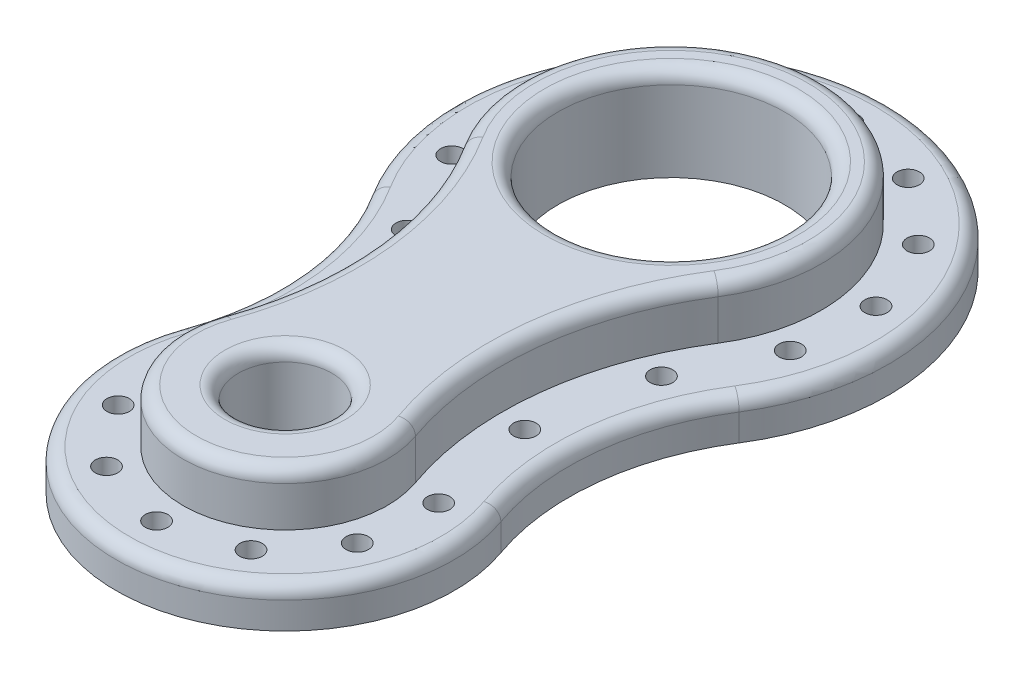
ISO-10303-21;
HEADER;
FILE_DESCRIPTION(('STEP AP214'),'2;1');
FILE_NAME('part.step','',(''),(''),'','','');
FILE_SCHEMA(('AUTOMOTIVE_DESIGN { 1 0 10303 214 1 1 1 1 }'));
ENDSEC;
DATA;
#1=APPLICATION_CONTEXT('core data for automotive mechanical design processes');
#2=APPLICATION_PROTOCOL_DEFINITION('international standard','automotive_design',2000,#1);
#3=PRODUCT_CONTEXT('',#1,'mechanical');
#4=PRODUCT('Part','Part','',(#3));
#5=PRODUCT_RELATED_PRODUCT_CATEGORY('part','',(#4));
#6=PRODUCT_DEFINITION_FORMATION('','',#4);
#7=PRODUCT_DEFINITION_CONTEXT('part definition',#1,'design');
#8=PRODUCT_DEFINITION('design','',#6,#7);
#9=PRODUCT_DEFINITION_SHAPE('','',#8);
#10=(LENGTH_UNIT() NAMED_UNIT(*) SI_UNIT(.MILLI.,.METRE.));
#11=(NAMED_UNIT(*) PLANE_ANGLE_UNIT() SI_UNIT($,.RADIAN.));
#12=(NAMED_UNIT(*) SI_UNIT($,.STERADIAN.) SOLID_ANGLE_UNIT());
#13=UNCERTAINTY_MEASURE_WITH_UNIT(LENGTH_MEASURE(1.E-05),#10,'distance_accuracy_value','');
#14=(GEOMETRIC_REPRESENTATION_CONTEXT(3) GLOBAL_UNCERTAINTY_ASSIGNED_CONTEXT((#13)) GLOBAL_UNIT_ASSIGNED_CONTEXT((#10,
#11,#12)) REPRESENTATION_CONTEXT('',''));
#15=CARTESIAN_POINT('',(0.,0.,0.));
#16=DIRECTION('',(0.,0.,1.));
#17=DIRECTION('',(1.,0.,0.));
#18=AXIS2_PLACEMENT_3D('',#15,#16,#17);
#19=CARTESIAN_POINT('',(37.2281633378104,7.62,-49.7239882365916));
#20=DIRECTION('',(0.,-1.,0.));
#21=DIRECTION('',(0.,0.,-1.));
#22=AXIS2_PLACEMENT_3D('',#19,#20,#21);
#23=PLANE('',#22);
#24=CARTESIAN_POINT('',(-13.6992201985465,7.62,20.1720306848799));
#25=DIRECTION('',(0.,1.,0.));
#26=DIRECTION('',(0.,0.,1.));
#27=AXIS2_PLACEMENT_3D('',#24,#25,#26);
#28=CIRCLE('',#27,2.1290551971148);
#29=CARTESIAN_POINT('',(-13.6992201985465,7.62,22.3010858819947));
#30=VERTEX_POINT('',#29);
#31=EDGE_CURVE('E484',#30,#30,#28,.T.);
#32=ORIENTED_EDGE('',*,*,#31,.F.);
#33=EDGE_LOOP('',(#32));
#34=FACE_BOUND('',#33,.T.);
#35=CARTESIAN_POINT('',(-22.6657718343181,7.62,8.99123145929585));
#36=DIRECTION('',(0.,1.,0.));
#37=DIRECTION('',(0.,0.,1.));
#38=AXIS2_PLACEMENT_3D('',#35,#36,#37);
#39=CIRCLE('',#38,2.1290551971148);
#40=CARTESIAN_POINT('',(-22.6657718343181,7.62,11.1202866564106));
#41=VERTEX_POINT('',#40);
#42=EDGE_CURVE('E486',#41,#41,#39,.T.);
#43=ORIENTED_EDGE('',*,*,#42,.F.);
#44=EDGE_LOOP('',(#43));
#45=FACE_BOUND('',#44,.T.);
#46=CARTESIAN_POINT('',(-23.8019809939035,7.62,-5.29576781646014));
#47=DIRECTION('',(0.,1.,0.));
#48=DIRECTION('',(0.,0.,1.));
#49=AXIS2_PLACEMENT_3D('',#46,#47,#48);
#50=CIRCLE('',#49,2.1290551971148);
#51=CARTESIAN_POINT('',(-23.8019809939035,7.62,-3.16671261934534));
#52=VERTEX_POINT('',#51);
#53=EDGE_CURVE('E492',#52,#52,#50,.T.);
#54=ORIENTED_EDGE('',*,*,#53,.F.);
#55=EDGE_LOOP('',(#54));
#56=FACE_BOUND('',#55,.T.);
#57=CARTESIAN_POINT('',(-19.8981874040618,7.62,-25.5370680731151));
#58=DIRECTION('',(0.,1.,0.));
#59=DIRECTION('',(0.,0.,1.));
#60=AXIS2_PLACEMENT_3D('',#57,#58,#59);
#61=CIRCLE('',#60,2.1290551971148);
#62=CARTESIAN_POINT('',(-19.8981874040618,7.62,-23.4080128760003));
#63=VERTEX_POINT('',#62);
#64=EDGE_CURVE('E498',#63,#63,#61,.T.);
#65=ORIENTED_EDGE('',*,*,#64,.F.);
#66=EDGE_LOOP('',(#65));
#67=FACE_BOUND('',#66,.T.);
#68=CARTESIAN_POINT('',(-24.0942564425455,7.62,-47.2399913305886));
#69=DIRECTION('',(0.,1.,0.));
#70=DIRECTION('',(0.,0.,1.));
#71=AXIS2_PLACEMENT_3D('',#68,#69,#70);
#72=CIRCLE('',#71,2.1290551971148);
#73=CARTESIAN_POINT('',(-24.0942564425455,7.62,-45.1109361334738));
#74=VERTEX_POINT('',#73);
#75=EDGE_CURVE('E504',#74,#74,#72,.T.);
#76=ORIENTED_EDGE('',*,*,#75,.F.);
#77=EDGE_LOOP('',(#76));
#78=FACE_BOUND('',#77,.T.);
#79=CARTESIAN_POINT('',(-32.0772385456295,7.62,-63.6698601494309));
#80=DIRECTION('',(0.,1.,0.));
#81=DIRECTION('',(0.,0.,1.));
#82=AXIS2_PLACEMENT_3D('',#79,#80,#81);
#83=CIRCLE('',#82,2.1290551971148);
#84=CARTESIAN_POINT('',(-32.0772385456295,7.62,-61.5408049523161));
#85=VERTEX_POINT('',#84);
#86=EDGE_CURVE('E510',#85,#85,#83,.T.);
#87=ORIENTED_EDGE('',*,*,#86,.F.);
#88=EDGE_LOOP('',(#87));
#89=FACE_BOUND('',#88,.T.);
#90=CARTESIAN_POINT('',(-32.9463323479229,7.62,-79.0632797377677));
#91=DIRECTION('',(0.,1.,0.));
#92=DIRECTION('',(0.,0.,1.));
#93=AXIS2_PLACEMENT_3D('',#90,#91,#92);
#94=CIRCLE('',#93,2.1290551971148);
#95=CARTESIAN_POINT('',(-32.9463323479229,7.62,-76.9342245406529));
#96=VERTEX_POINT('',#95);
#97=EDGE_CURVE('E516',#96,#96,#94,.T.);
#98=ORIENTED_EDGE('',*,*,#97,.F.);
#99=EDGE_LOOP('',(#98));
#100=FACE_BOUND('',#99,.T.);
#101=CARTESIAN_POINT('',(-26.8216188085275,7.62,-93.2125049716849));
#102=DIRECTION('',(0.,1.,0.));
#103=DIRECTION('',(0.,0.,1.));
#104=AXIS2_PLACEMENT_3D('',#101,#102,#103);
#105=CIRCLE('',#104,2.1290551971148);
#106=CARTESIAN_POINT('',(-26.8216188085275,7.62,-91.0834497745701));
#107=VERTEX_POINT('',#106);
#108=EDGE_CURVE('E522',#107,#107,#105,.T.);
#109=ORIENTED_EDGE('',*,*,#108,.F.);
#110=EDGE_LOOP('',(#109));
#111=FACE_BOUND('',#110,.T.);
#112=CARTESIAN_POINT('',(-15.0032446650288,7.62,-103.113955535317));
#113=DIRECTION('',(0.,1.,0.));
#114=DIRECTION('',(0.,0.,1.));
#115=AXIS2_PLACEMENT_3D('',#112,#113,#114);
#116=CIRCLE('',#115,2.1290551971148);
#117=CARTESIAN_POINT('',(-15.0032446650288,7.62,-100.984900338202));
#118=VERTEX_POINT('',#117);
#119=EDGE_CURVE('E528',#118,#118,#116,.T.);
#120=ORIENTED_EDGE('',*,*,#119,.F.);
#121=EDGE_LOOP('',(#120));
#122=FACE_BOUND('',#121,.T.);
#123=CARTESIAN_POINT('',(0.,7.62,-106.665763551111));
#124=DIRECTION('',(0.,1.,0.));
#125=DIRECTION('',(0.,0.,1.));
#126=AXIS2_PLACEMENT_3D('',#123,#124,#125);
#127=CIRCLE('',#126,2.1290551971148);
#128=CARTESIAN_POINT('',(0.,7.62,-104.536708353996));
#129=VERTEX_POINT('',#128);
#130=EDGE_CURVE('E534',#129,#129,#127,.T.);
#131=ORIENTED_EDGE('',*,*,#130,.F.);
#132=EDGE_LOOP('',(#131));
#133=FACE_BOUND('',#132,.T.);
#134=CARTESIAN_POINT('',(15.0032446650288,7.62,-103.113955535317));
#135=DIRECTION('',(0.,1.,0.));
#136=DIRECTION('',(0.,0.,1.));
#137=AXIS2_PLACEMENT_3D('',#134,#135,#136);
#138=CIRCLE('',#137,2.1290551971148);
#139=CARTESIAN_POINT('',(15.0032446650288,7.62,-100.984900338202));
#140=VERTEX_POINT('',#139);
#141=EDGE_CURVE('E540',#140,#140,#138,.T.);
#142=ORIENTED_EDGE('',*,*,#141,.F.);
#143=EDGE_LOOP('',(#142));
#144=FACE_BOUND('',#143,.T.);
#145=CARTESIAN_POINT('',(26.8216188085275,7.62,-93.2125049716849));
#146=DIRECTION('',(0.,1.,0.));
#147=DIRECTION('',(0.,0.,1.));
#148=AXIS2_PLACEMENT_3D('',#145,#146,#147);
#149=CIRCLE('',#148,2.1290551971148);
#150=CARTESIAN_POINT('',(26.8216188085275,7.62,-91.0834497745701));
#151=VERTEX_POINT('',#150);
#152=EDGE_CURVE('E546',#151,#151,#149,.T.);
#153=ORIENTED_EDGE('',*,*,#152,.F.);
#154=EDGE_LOOP('',(#153));
#155=FACE_BOUND('',#154,.T.);
#156=CARTESIAN_POINT('',(32.9463323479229,7.62,-79.0632797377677));
#157=DIRECTION('',(0.,1.,0.));
#158=DIRECTION('',(0.,0.,1.));
#159=AXIS2_PLACEMENT_3D('',#156,#157,#158);
#160=CIRCLE('',#159,2.1290551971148);
#161=CARTESIAN_POINT('',(32.9463323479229,7.62,-76.9342245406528));
#162=VERTEX_POINT('',#161);
#163=EDGE_CURVE('E552',#162,#162,#160,.T.);
#164=ORIENTED_EDGE('',*,*,#163,.F.);
#165=EDGE_LOOP('',(#164));
#166=FACE_BOUND('',#165,.T.);
#167=CARTESIAN_POINT('',(32.0772385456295,7.62,-63.6698601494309));
#168=DIRECTION('',(0.,1.,0.));
#169=DIRECTION('',(0.,0.,1.));
#170=AXIS2_PLACEMENT_3D('',#167,#168,#169);
#171=CIRCLE('',#170,2.1290551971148);
#172=CARTESIAN_POINT('',(32.0772385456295,7.62,-61.5408049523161));
#173=VERTEX_POINT('',#172);
#174=EDGE_CURVE('E558',#173,#173,#171,.T.);
#175=ORIENTED_EDGE('',*,*,#174,.F.);
#176=EDGE_LOOP('',(#175));
#177=FACE_BOUND('',#176,.T.);
#178=CARTESIAN_POINT('',(24.0942564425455,7.62,-47.2399913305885));
#179=DIRECTION('',(0.,1.,0.));
#180=DIRECTION('',(0.,0.,1.));
#181=AXIS2_PLACEMENT_3D('',#178,#179,#180);
#182=CIRCLE('',#181,2.1290551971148);
#183=CARTESIAN_POINT('',(24.0942564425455,7.62,-45.1109361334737));
#184=VERTEX_POINT('',#183);
#185=EDGE_CURVE('E564',#184,#184,#182,.T.);
#186=ORIENTED_EDGE('',*,*,#185,.F.);
#187=EDGE_LOOP('',(#186));
#188=FACE_BOUND('',#187,.T.);
#189=CARTESIAN_POINT('',(19.8981874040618,7.62,-25.537068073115));
#190=DIRECTION('',(0.,1.,0.));
#191=DIRECTION('',(0.,0.,1.));
#192=AXIS2_PLACEMENT_3D('',#189,#190,#191);
#193=CIRCLE('',#192,2.1290551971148);
#194=CARTESIAN_POINT('',(19.8981874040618,7.62,-23.4080128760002));
#195=VERTEX_POINT('',#194);
#196=EDGE_CURVE('E570',#195,#195,#193,.T.);
#197=ORIENTED_EDGE('',*,*,#196,.F.);
#198=EDGE_LOOP('',(#197));
#199=FACE_BOUND('',#198,.T.);
#200=CARTESIAN_POINT('',(23.8019809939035,7.62,-5.29576781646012));
#201=DIRECTION('',(0.,1.,0.));
#202=DIRECTION('',(0.,0.,1.));
#203=AXIS2_PLACEMENT_3D('',#200,#201,#202);
#204=CIRCLE('',#203,2.1290551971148);
#205=CARTESIAN_POINT('',(23.8019809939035,7.62,-3.16671261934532));
#206=VERTEX_POINT('',#205);
#207=EDGE_CURVE('E576',#206,#206,#204,.T.);
#208=ORIENTED_EDGE('',*,*,#207,.F.);
#209=EDGE_LOOP('',(#208));
#210=FACE_BOUND('',#209,.T.);
#211=CARTESIAN_POINT('',(22.6657718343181,7.62,8.99123145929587));
#212=DIRECTION('',(0.,1.,0.));
#213=DIRECTION('',(0.,0.,1.));
#214=AXIS2_PLACEMENT_3D('',#211,#212,#213);
#215=CIRCLE('',#214,2.1290551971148);
#216=CARTESIAN_POINT('',(22.6657718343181,7.62,11.1202866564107));
#217=VERTEX_POINT('',#216);
#218=EDGE_CURVE('E582',#217,#217,#215,.T.);
#219=ORIENTED_EDGE('',*,*,#218,.F.);
#220=EDGE_LOOP('',(#219));
#221=FACE_BOUND('',#220,.T.);
#222=CARTESIAN_POINT('',(13.6992201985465,7.62,20.1720306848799));
#223=DIRECTION('',(0.,1.,0.));
#224=DIRECTION('',(0.,0.,1.));
#225=AXIS2_PLACEMENT_3D('',#222,#223,#224);
#226=CIRCLE('',#225,2.1290551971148);
#227=CARTESIAN_POINT('',(13.6992201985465,7.62,22.3010858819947));
#228=VERTEX_POINT('',#227);
#229=EDGE_CURVE('E588',#228,#228,#226,.T.);
#230=ORIENTED_EDGE('',*,*,#229,.F.);
#231=EDGE_LOOP('',(#230));
#232=FACE_BOUND('',#231,.T.);
#233=CARTESIAN_POINT('',(0.,7.62,24.384));
#234=DIRECTION('',(0.,1.,0.));
#235=DIRECTION('',(0.,0.,1.));
#236=AXIS2_PLACEMENT_3D('',#233,#234,#235);
#237=CIRCLE('',#236,2.1290551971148);
#238=CARTESIAN_POINT('',(0.,7.62,26.5130551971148));
#239=VERTEX_POINT('',#238);
#240=EDGE_CURVE('E366',#239,#239,#237,.T.);
#241=ORIENTED_EDGE('',*,*,#240,.F.);
#242=EDGE_LOOP('',(#241));
#243=FACE_BOUND('',#242,.T.);
#244=CARTESIAN_POINT('',(0.,7.62,0.));
#245=DIRECTION('',(0.,-1.,0.));
#246=DIRECTION('',(0.,0.,-1.));
#247=AXIS2_PLACEMENT_3D('',#244,#245,#246);
#248=CIRCLE('',#247,29.5212641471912);
#249=CARTESIAN_POINT('',(-27.8421225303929,7.62,-9.81433899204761));
#250=VERTEX_POINT('',#249);
#251=CARTESIAN_POINT('',(27.8421225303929,7.62,-9.8143389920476));
#252=VERTEX_POINT('',#251);
#253=EDGE_CURVE('E242',#250,#252,#248,.F.);
#254=ORIENTED_EDGE('',*,*,#253,.T.);
#255=CARTESIAN_POINT('',(74.4563266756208,7.62,-26.2458305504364));
#256=DIRECTION('',(0.,-1.,0.));
#257=DIRECTION('',(0.,0.,-1.));
#258=AXIS2_PLACEMENT_3D('',#255,#256,#257);
#259=CIRCLE('',#258,49.4254786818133);
#260=CARTESIAN_POINT('',(32.6502180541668,7.62,-52.611096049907));
#261=VERTEX_POINT('',#260);
#262=EDGE_CURVE('E244',#252,#261,#259,.T.);
#263=ORIENTED_EDGE('',*,*,#262,.T.);
#264=CARTESIAN_POINT('',(0.,7.62,-73.2021459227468));
#265=DIRECTION('',(0.,-1.,0.));
#266=DIRECTION('',(0.,0.,-1.));
#267=AXIS2_PLACEMENT_3D('',#264,#265,#266);
#268=CIRCLE('',#267,38.6008817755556);
#269=CARTESIAN_POINT('',(-32.6502180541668,7.62,-52.611096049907));
#270=VERTEX_POINT('',#269);
#271=EDGE_CURVE('E227',#261,#270,#268,.F.);
#272=ORIENTED_EDGE('',*,*,#271,.T.);
#273=CARTESIAN_POINT('',(-74.4563266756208,7.62,-26.2458305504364));
#274=DIRECTION('',(0.,-1.,0.));
#275=DIRECTION('',(0.,0.,-1.));
#276=AXIS2_PLACEMENT_3D('',#273,#274,#275);
#277=CIRCLE('',#276,49.4254786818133);
#278=EDGE_CURVE('E240',#270,#250,#277,.T.);
#279=ORIENTED_EDGE('',*,*,#278,.T.);
#280=EDGE_LOOP('',(#254,#263,#272,#279));
#281=FACE_BOUND('',#280,.T.);
#282=CARTESIAN_POINT('',(74.4563266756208,7.62,-26.2458305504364));
#283=DIRECTION('',(0.,-1.,0.));
#284=DIRECTION('',(0.,0.,1.));
#285=AXIS2_PLACEMENT_3D('',#282,#283,#284);
#286=CIRCLE('',#285,59.5854786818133);
#287=CARTESIAN_POINT('',(18.2600137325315,7.62,-6.43664880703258));
#288=VERTEX_POINT('',#287);
#289=CARTESIAN_POINT('',(24.0564709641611,7.62,-58.0307926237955));
#290=VERTEX_POINT('',#289);
#291=EDGE_CURVE('E160',#288,#290,#286,.T.);
#292=ORIENTED_EDGE('',*,*,#291,.F.);
#293=CARTESIAN_POINT('',(0.,7.62,0.));
#294=DIRECTION('',(0.,1.,0.));
#295=DIRECTION('',(0.,0.,1.));
#296=AXIS2_PLACEMENT_3D('',#293,#294,#295);
#297=CIRCLE('',#296,19.3612641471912);
#298=CARTESIAN_POINT('',(-18.2600137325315,7.62,-6.4366488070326));
#299=VERTEX_POINT('',#298);
#300=EDGE_CURVE('E167',#299,#288,#297,.T.);
#301=ORIENTED_EDGE('',*,*,#300,.F.);
#302=CARTESIAN_POINT('',(-74.4563266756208,7.62,-26.2458305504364));
#303=DIRECTION('',(0.,-1.,0.));
#304=DIRECTION('',(0.,0.,1.));
#305=AXIS2_PLACEMENT_3D('',#302,#303,#304);
#306=CIRCLE('',#305,59.5854786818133);
#307=CARTESIAN_POINT('',(-24.0564709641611,7.62,-58.0307926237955));
#308=VERTEX_POINT('',#307);
#309=EDGE_CURVE('E180',#308,#299,#306,.T.);
#310=ORIENTED_EDGE('',*,*,#309,.F.);
#311=CARTESIAN_POINT('',(0.,7.62,-73.2021459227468));
#312=DIRECTION('',(0.,1.,0.));
#313=DIRECTION('',(0.,0.,1.));
#314=AXIS2_PLACEMENT_3D('',#311,#312,#313);
#315=CIRCLE('',#314,28.4408817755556);
#316=EDGE_CURVE('E175',#290,#308,#315,.T.);
#317=ORIENTED_EDGE('',*,*,#316,.F.);
#318=EDGE_LOOP('',(#292,#301,#310,#317));
#319=FACE_BOUND('',#318,.T.);
#320=ADVANCED_FACE('F64',(#34,#45,#56,#67,#78,#89,#100,#111,#122,#133,#144,#155,#166,#177,#188,
#199,#210,#221,#232,#243,#281,#319),#23,.F.);
#321=CARTESIAN_POINT('',(74.4563266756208,7.62,-26.2458305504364));
#322=DIRECTION('',(0.,-1.,0.));
#323=DIRECTION('',(0.,0.,-1.));
#324=AXIS2_PLACEMENT_3D('',#321,#322,#323);
#325=CYLINDRICAL_SURFACE('',#324,46.8854786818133);
#326=DIRECTION('',(0.,-1.,0.));
#327=VECTOR('',#326,1.);
#328=CARTESIAN_POINT('',(34.7986548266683,7.62,-51.2561719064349));
#329=LINE('',#328,#327);
#330=CARTESIAN_POINT('',(34.7986548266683,5.08,-51.2561719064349));
#331=VERTEX_POINT('',#330);
#332=CARTESIAN_POINT('',(34.7986548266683,0.,-51.2561719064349));
#333=VERTEX_POINT('',#332);
#334=EDGE_CURVE('E208',#331,#333,#329,.T.);
#335=ORIENTED_EDGE('',*,*,#334,.F.);
#336=CARTESIAN_POINT('',(74.4563266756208,5.08,-26.2458305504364));
#337=DIRECTION('',(0.,-1.,0.));
#338=DIRECTION('',(0.,0.,-1.));
#339=AXIS2_PLACEMENT_3D('',#336,#337,#338);
#340=CIRCLE('',#339,46.8854786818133);
#341=CARTESIAN_POINT('',(30.2376497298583,5.08,-10.6587615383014));
#342=VERTEX_POINT('',#341);
#343=EDGE_CURVE('E247',#331,#342,#340,.F.);
#344=ORIENTED_EDGE('',*,*,#343,.T.);
#345=DIRECTION('',(0.,-1.,0.));
#346=VECTOR('',#345,1.);
#347=CARTESIAN_POINT('',(30.2376497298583,7.62,-10.6587615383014));
#348=LINE('',#347,#346);
#349=CARTESIAN_POINT('',(30.2376497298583,0.,-10.6587615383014));
#350=VERTEX_POINT('',#349);
#351=EDGE_CURVE('E202',#342,#350,#348,.T.);
#352=ORIENTED_EDGE('',*,*,#351,.T.);
#353=CARTESIAN_POINT('',(74.4563266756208,0.,-26.2458305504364));
#354=DIRECTION('',(0.,-1.,0.));
#355=DIRECTION('',(0.,0.,-1.));
#356=AXIS2_PLACEMENT_3D('',#353,#354,#355);
#357=CIRCLE('',#356,46.8854786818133);
#358=EDGE_CURVE('E190',#350,#333,#357,.T.);
#359=ORIENTED_EDGE('',*,*,#358,.T.);
#360=EDGE_LOOP('',(#335,#344,#352,#359));
#361=FACE_BOUND('',#360,.T.);
#362=ADVANCED_FACE('F289',(#361),#325,.F.);
#363=CARTESIAN_POINT('',(0.,7.62,-73.2021459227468));
#364=DIRECTION('',(0.,-1.,0.));
#365=DIRECTION('',(0.,0.,-1.));
#366=AXIS2_PLACEMENT_3D('',#363,#364,#365);
#367=CYLINDRICAL_SURFACE('',#366,41.1408817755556);
#368=DIRECTION('',(0.,-1.,0.));
#369=VECTOR('',#368,1.);
#370=CARTESIAN_POINT('',(-34.7986548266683,7.62,-51.2561719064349));
#371=LINE('',#370,#369);
#372=CARTESIAN_POINT('',(-34.7986548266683,5.08,-51.2561719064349));
#373=VERTEX_POINT('',#372);
#374=CARTESIAN_POINT('',(-34.7986548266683,0.,-51.2561719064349));
#375=VERTEX_POINT('',#374);
#376=EDGE_CURVE('E206',#373,#375,#371,.T.);
#377=ORIENTED_EDGE('',*,*,#376,.F.);
#378=CARTESIAN_POINT('',(0.,5.08,-73.2021459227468));
#379=DIRECTION('',(0.,-1.,0.));
#380=DIRECTION('',(0.,0.,-1.));
#381=AXIS2_PLACEMENT_3D('',#378,#379,#380);
#382=CIRCLE('',#381,41.1408817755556);
#383=EDGE_CURVE('E73',#373,#331,#382,.T.);
#384=ORIENTED_EDGE('',*,*,#383,.T.);
#385=ORIENTED_EDGE('',*,*,#334,.T.);
#386=CARTESIAN_POINT('',(0.,0.,-73.2021459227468));
#387=DIRECTION('',(0.,1.,0.));
#388=DIRECTION('',(0.,0.,1.));
#389=AXIS2_PLACEMENT_3D('',#386,#387,#388);
#390=CIRCLE('',#389,41.1408817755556);
#391=EDGE_CURVE('E193',#333,#375,#390,.T.);
#392=ORIENTED_EDGE('',*,*,#391,.T.);
#393=EDGE_LOOP('',(#377,#384,#385,#392));
#394=FACE_BOUND('',#393,.T.);
#395=ADVANCED_FACE('F285',(#394),#367,.T.);
#396=CARTESIAN_POINT('',(-74.4563266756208,7.62,-26.2458305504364));
#397=DIRECTION('',(0.,-1.,0.));
#398=DIRECTION('',(0.,0.,-1.));
#399=AXIS2_PLACEMENT_3D('',#396,#397,#398);
#400=CYLINDRICAL_SURFACE('',#399,46.8854786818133);
#401=DIRECTION('',(0.,-1.,0.));
#402=VECTOR('',#401,1.);
#403=CARTESIAN_POINT('',(-30.2376497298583,7.62,-10.6587615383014));
#404=LINE('',#403,#402);
#405=CARTESIAN_POINT('',(-30.2376497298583,5.08,-10.6587615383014));
#406=VERTEX_POINT('',#405);
#407=CARTESIAN_POINT('',(-30.2376497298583,0.,-10.6587615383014));
#408=VERTEX_POINT('',#407);
#409=EDGE_CURVE('E204',#406,#408,#404,.T.);
#410=ORIENTED_EDGE('',*,*,#409,.F.);
#411=CARTESIAN_POINT('',(-74.4563266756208,5.08,-26.2458305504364));
#412=DIRECTION('',(0.,-1.,0.));
#413=DIRECTION('',(0.,0.,-1.));
#414=AXIS2_PLACEMENT_3D('',#411,#412,#413);
#415=CIRCLE('',#414,46.8854786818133);
#416=EDGE_CURVE('E81',#406,#373,#415,.F.);
#417=ORIENTED_EDGE('',*,*,#416,.T.);
#418=ORIENTED_EDGE('',*,*,#376,.T.);
#419=CARTESIAN_POINT('',(-74.4563266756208,0.,-26.2458305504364));
#420=DIRECTION('',(0.,-1.,0.));
#421=DIRECTION('',(0.,0.,1.));
#422=AXIS2_PLACEMENT_3D('',#419,#420,#421);
#423=CIRCLE('',#422,46.8854786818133);
#424=EDGE_CURVE('E196',#375,#408,#423,.T.);
#425=ORIENTED_EDGE('',*,*,#424,.T.);
#426=EDGE_LOOP('',(#410,#417,#418,#425));
#427=FACE_BOUND('',#426,.T.);
#428=ADVANCED_FACE('F314',(#427),#400,.F.);
#429=CARTESIAN_POINT('',(0.,7.62,0.));
#430=DIRECTION('',(0.,-1.,0.));
#431=DIRECTION('',(0.,0.,-1.));
#432=AXIS2_PLACEMENT_3D('',#429,#430,#431);
#433=CYLINDRICAL_SURFACE('',#432,32.0612641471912);
#434=ORIENTED_EDGE('',*,*,#351,.F.);
#435=CARTESIAN_POINT('',(0.,5.08,0.));
#436=DIRECTION('',(0.,-1.,0.));
#437=DIRECTION('',(0.,0.,-1.));
#438=AXIS2_PLACEMENT_3D('',#435,#436,#437);
#439=CIRCLE('',#438,32.0612641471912);
#440=EDGE_CURVE('E89',#342,#406,#439,.T.);
#441=ORIENTED_EDGE('',*,*,#440,.T.);
#442=ORIENTED_EDGE('',*,*,#409,.T.);
#443=CARTESIAN_POINT('',(0.,0.,0.));
#444=DIRECTION('',(0.,1.,0.));
#445=DIRECTION('',(0.,0.,1.));
#446=AXIS2_PLACEMENT_3D('',#443,#444,#445);
#447=CIRCLE('',#446,32.0612641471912);
#448=EDGE_CURVE('E199',#408,#350,#447,.T.);
#449=ORIENTED_EDGE('',*,*,#448,.T.);
#450=EDGE_LOOP('',(#434,#441,#442,#449));
#451=FACE_BOUND('',#450,.T.);
#452=ADVANCED_FACE('F310',(#451),#433,.T.);
#453=CARTESIAN_POINT('',(37.2281633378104,0.,-49.7239882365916));
#454=DIRECTION('',(0.,-1.,0.));
#455=DIRECTION('',(0.,0.,-1.));
#456=AXIS2_PLACEMENT_3D('',#453,#454,#455);
#457=PLANE('',#456);
#458=CARTESIAN_POINT('',(-13.6992201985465,0.,20.1720306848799));
#459=DIRECTION('',(0.,1.,0.));
#460=DIRECTION('',(0.,0.,1.));
#461=AXIS2_PLACEMENT_3D('',#458,#459,#460);
#462=CIRCLE('',#461,2.1290551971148);
#463=CARTESIAN_POINT('',(-13.6992201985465,0.,22.3010858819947));
#464=VERTEX_POINT('',#463);
#465=EDGE_CURVE('E482',#464,#464,#462,.T.);
#466=ORIENTED_EDGE('',*,*,#465,.T.);
#467=EDGE_LOOP('',(#466));
#468=FACE_BOUND('',#467,.T.);
#469=CARTESIAN_POINT('',(-22.6657718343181,0.,8.99123145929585));
#470=DIRECTION('',(0.,1.,0.));
#471=DIRECTION('',(0.,0.,1.));
#472=AXIS2_PLACEMENT_3D('',#469,#470,#471);
#473=CIRCLE('',#472,2.1290551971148);
#474=CARTESIAN_POINT('',(-22.6657718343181,0.,11.1202866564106));
#475=VERTEX_POINT('',#474);
#476=EDGE_CURVE('E489',#475,#475,#473,.T.);
#477=ORIENTED_EDGE('',*,*,#476,.T.);
#478=EDGE_LOOP('',(#477));
#479=FACE_BOUND('',#478,.T.);
#480=CARTESIAN_POINT('',(-23.8019809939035,0.,-5.29576781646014));
#481=DIRECTION('',(0.,1.,0.));
#482=DIRECTION('',(0.,0.,1.));
#483=AXIS2_PLACEMENT_3D('',#480,#481,#482);
#484=CIRCLE('',#483,2.1290551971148);
#485=CARTESIAN_POINT('',(-23.8019809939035,0.,-3.16671261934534));
#486=VERTEX_POINT('',#485);
#487=EDGE_CURVE('E495',#486,#486,#484,.T.);
#488=ORIENTED_EDGE('',*,*,#487,.T.);
#489=EDGE_LOOP('',(#488));
#490=FACE_BOUND('',#489,.T.);
#491=CARTESIAN_POINT('',(-19.8981874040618,0.,-25.5370680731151));
#492=DIRECTION('',(0.,1.,0.));
#493=DIRECTION('',(0.,0.,1.));
#494=AXIS2_PLACEMENT_3D('',#491,#492,#493);
#495=CIRCLE('',#494,2.1290551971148);
#496=CARTESIAN_POINT('',(-19.8981874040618,0.,-23.4080128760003));
#497=VERTEX_POINT('',#496);
#498=EDGE_CURVE('E501',#497,#497,#495,.T.);
#499=ORIENTED_EDGE('',*,*,#498,.T.);
#500=EDGE_LOOP('',(#499));
#501=FACE_BOUND('',#500,.T.);
#502=CARTESIAN_POINT('',(-24.0942564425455,0.,-47.2399913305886));
#503=DIRECTION('',(0.,1.,0.));
#504=DIRECTION('',(0.,0.,1.));
#505=AXIS2_PLACEMENT_3D('',#502,#503,#504);
#506=CIRCLE('',#505,2.1290551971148);
#507=CARTESIAN_POINT('',(-24.0942564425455,0.,-45.1109361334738));
#508=VERTEX_POINT('',#507);
#509=EDGE_CURVE('E507',#508,#508,#506,.T.);
#510=ORIENTED_EDGE('',*,*,#509,.T.);
#511=EDGE_LOOP('',(#510));
#512=FACE_BOUND('',#511,.T.);
#513=CARTESIAN_POINT('',(-32.0772385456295,0.,-63.6698601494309));
#514=DIRECTION('',(0.,1.,0.));
#515=DIRECTION('',(0.,0.,1.));
#516=AXIS2_PLACEMENT_3D('',#513,#514,#515);
#517=CIRCLE('',#516,2.1290551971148);
#518=CARTESIAN_POINT('',(-32.0772385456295,0.,-61.5408049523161));
#519=VERTEX_POINT('',#518);
#520=EDGE_CURVE('E513',#519,#519,#517,.T.);
#521=ORIENTED_EDGE('',*,*,#520,.T.);
#522=EDGE_LOOP('',(#521));
#523=FACE_BOUND('',#522,.T.);
#524=CARTESIAN_POINT('',(-32.9463323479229,0.,-79.0632797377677));
#525=DIRECTION('',(0.,1.,0.));
#526=DIRECTION('',(0.,0.,1.));
#527=AXIS2_PLACEMENT_3D('',#524,#525,#526);
#528=CIRCLE('',#527,2.1290551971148);
#529=CARTESIAN_POINT('',(-32.9463323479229,0.,-76.9342245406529));
#530=VERTEX_POINT('',#529);
#531=EDGE_CURVE('E519',#530,#530,#528,.T.);
#532=ORIENTED_EDGE('',*,*,#531,.T.);
#533=EDGE_LOOP('',(#532));
#534=FACE_BOUND('',#533,.T.);
#535=CARTESIAN_POINT('',(-26.8216188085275,0.,-93.2125049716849));
#536=DIRECTION('',(0.,1.,0.));
#537=DIRECTION('',(0.,0.,1.));
#538=AXIS2_PLACEMENT_3D('',#535,#536,#537);
#539=CIRCLE('',#538,2.1290551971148);
#540=CARTESIAN_POINT('',(-26.8216188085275,0.,-91.0834497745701));
#541=VERTEX_POINT('',#540);
#542=EDGE_CURVE('E525',#541,#541,#539,.T.);
#543=ORIENTED_EDGE('',*,*,#542,.T.);
#544=EDGE_LOOP('',(#543));
#545=FACE_BOUND('',#544,.T.);
#546=CARTESIAN_POINT('',(-15.0032446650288,0.,-103.113955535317));
#547=DIRECTION('',(0.,1.,0.));
#548=DIRECTION('',(0.,0.,1.));
#549=AXIS2_PLACEMENT_3D('',#546,#547,#548);
#550=CIRCLE('',#549,2.1290551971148);
#551=CARTESIAN_POINT('',(-15.0032446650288,0.,-100.984900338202));
#552=VERTEX_POINT('',#551);
#553=EDGE_CURVE('E531',#552,#552,#550,.T.);
#554=ORIENTED_EDGE('',*,*,#553,.T.);
#555=EDGE_LOOP('',(#554));
#556=FACE_BOUND('',#555,.T.);
#557=CARTESIAN_POINT('',(0.,0.,-106.665763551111));
#558=DIRECTION('',(0.,1.,0.));
#559=DIRECTION('',(0.,0.,1.));
#560=AXIS2_PLACEMENT_3D('',#557,#558,#559);
#561=CIRCLE('',#560,2.1290551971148);
#562=CARTESIAN_POINT('',(0.,0.,-104.536708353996));
#563=VERTEX_POINT('',#562);
#564=EDGE_CURVE('E537',#563,#563,#561,.T.);
#565=ORIENTED_EDGE('',*,*,#564,.T.);
#566=EDGE_LOOP('',(#565));
#567=FACE_BOUND('',#566,.T.);
#568=CARTESIAN_POINT('',(15.0032446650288,0.,-103.113955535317));
#569=DIRECTION('',(0.,1.,0.));
#570=DIRECTION('',(0.,0.,1.));
#571=AXIS2_PLACEMENT_3D('',#568,#569,#570);
#572=CIRCLE('',#571,2.1290551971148);
#573=CARTESIAN_POINT('',(15.0032446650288,0.,-100.984900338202));
#574=VERTEX_POINT('',#573);
#575=EDGE_CURVE('E543',#574,#574,#572,.T.);
#576=ORIENTED_EDGE('',*,*,#575,.T.);
#577=EDGE_LOOP('',(#576));
#578=FACE_BOUND('',#577,.T.);
#579=CARTESIAN_POINT('',(26.8216188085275,0.,-93.2125049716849));
#580=DIRECTION('',(0.,1.,0.));
#581=DIRECTION('',(0.,0.,1.));
#582=AXIS2_PLACEMENT_3D('',#579,#580,#581);
#583=CIRCLE('',#582,2.1290551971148);
#584=CARTESIAN_POINT('',(26.8216188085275,0.,-91.0834497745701));
#585=VERTEX_POINT('',#584);
#586=EDGE_CURVE('E549',#585,#585,#583,.T.);
#587=ORIENTED_EDGE('',*,*,#586,.T.);
#588=EDGE_LOOP('',(#587));
#589=FACE_BOUND('',#588,.T.);
#590=CARTESIAN_POINT('',(32.9463323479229,0.,-79.0632797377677));
#591=DIRECTION('',(0.,1.,0.));
#592=DIRECTION('',(0.,0.,1.));
#593=AXIS2_PLACEMENT_3D('',#590,#591,#592);
#594=CIRCLE('',#593,2.1290551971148);
#595=CARTESIAN_POINT('',(32.9463323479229,0.,-76.9342245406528));
#596=VERTEX_POINT('',#595);
#597=EDGE_CURVE('E555',#596,#596,#594,.T.);
#598=ORIENTED_EDGE('',*,*,#597,.T.);
#599=EDGE_LOOP('',(#598));
#600=FACE_BOUND('',#599,.T.);
#601=CARTESIAN_POINT('',(32.0772385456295,0.,-63.6698601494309));
#602=DIRECTION('',(0.,1.,0.));
#603=DIRECTION('',(0.,0.,1.));
#604=AXIS2_PLACEMENT_3D('',#601,#602,#603);
#605=CIRCLE('',#604,2.1290551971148);
#606=CARTESIAN_POINT('',(32.0772385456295,0.,-61.5408049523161));
#607=VERTEX_POINT('',#606);
#608=EDGE_CURVE('E561',#607,#607,#605,.T.);
#609=ORIENTED_EDGE('',*,*,#608,.T.);
#610=EDGE_LOOP('',(#609));
#611=FACE_BOUND('',#610,.T.);
#612=CARTESIAN_POINT('',(24.0942564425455,0.,-47.2399913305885));
#613=DIRECTION('',(0.,1.,0.));
#614=DIRECTION('',(0.,0.,1.));
#615=AXIS2_PLACEMENT_3D('',#612,#613,#614);
#616=CIRCLE('',#615,2.1290551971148);
#617=CARTESIAN_POINT('',(24.0942564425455,0.,-45.1109361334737));
#618=VERTEX_POINT('',#617);
#619=EDGE_CURVE('E567',#618,#618,#616,.T.);
#620=ORIENTED_EDGE('',*,*,#619,.T.);
#621=EDGE_LOOP('',(#620));
#622=FACE_BOUND('',#621,.T.);
#623=CARTESIAN_POINT('',(19.8981874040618,0.,-25.537068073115));
#624=DIRECTION('',(0.,1.,0.));
#625=DIRECTION('',(0.,0.,1.));
#626=AXIS2_PLACEMENT_3D('',#623,#624,#625);
#627=CIRCLE('',#626,2.1290551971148);
#628=CARTESIAN_POINT('',(19.8981874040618,0.,-23.4080128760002));
#629=VERTEX_POINT('',#628);
#630=EDGE_CURVE('E573',#629,#629,#627,.T.);
#631=ORIENTED_EDGE('',*,*,#630,.T.);
#632=EDGE_LOOP('',(#631));
#633=FACE_BOUND('',#632,.T.);
#634=CARTESIAN_POINT('',(23.8019809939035,0.,-5.29576781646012));
#635=DIRECTION('',(0.,1.,0.));
#636=DIRECTION('',(0.,0.,1.));
#637=AXIS2_PLACEMENT_3D('',#634,#635,#636);
#638=CIRCLE('',#637,2.1290551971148);
#639=CARTESIAN_POINT('',(23.8019809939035,0.,-3.16671261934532));
#640=VERTEX_POINT('',#639);
#641=EDGE_CURVE('E579',#640,#640,#638,.T.);
#642=ORIENTED_EDGE('',*,*,#641,.T.);
#643=EDGE_LOOP('',(#642));
#644=FACE_BOUND('',#643,.T.);
#645=CARTESIAN_POINT('',(22.6657718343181,0.,8.99123145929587));
#646=DIRECTION('',(0.,1.,0.));
#647=DIRECTION('',(0.,0.,1.));
#648=AXIS2_PLACEMENT_3D('',#645,#646,#647);
#649=CIRCLE('',#648,2.1290551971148);
#650=CARTESIAN_POINT('',(22.6657718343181,0.,11.1202866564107));
#651=VERTEX_POINT('',#650);
#652=EDGE_CURVE('E585',#651,#651,#649,.T.);
#653=ORIENTED_EDGE('',*,*,#652,.T.);
#654=EDGE_LOOP('',(#653));
#655=FACE_BOUND('',#654,.T.);
#656=CARTESIAN_POINT('',(13.6992201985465,0.,20.1720306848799));
#657=DIRECTION('',(0.,1.,0.));
#658=DIRECTION('',(0.,0.,1.));
#659=AXIS2_PLACEMENT_3D('',#656,#657,#658);
#660=CIRCLE('',#659,2.1290551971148);
#661=CARTESIAN_POINT('',(13.6992201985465,0.,22.3010858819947));
#662=VERTEX_POINT('',#661);
#663=EDGE_CURVE('E591',#662,#662,#660,.T.);
#664=ORIENTED_EDGE('',*,*,#663,.T.);
#665=EDGE_LOOP('',(#664));
#666=FACE_BOUND('',#665,.T.);
#667=CARTESIAN_POINT('',(0.,0.,24.384));
#668=DIRECTION('',(0.,1.,0.));
#669=DIRECTION('',(0.,0.,1.));
#670=AXIS2_PLACEMENT_3D('',#667,#668,#669);
#671=CIRCLE('',#670,2.1290551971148);
#672=CARTESIAN_POINT('',(0.,0.,26.5130551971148));
#673=VERTEX_POINT('',#672);
#674=EDGE_CURVE('E265',#673,#673,#671,.T.);
#675=ORIENTED_EDGE('',*,*,#674,.T.);
#676=EDGE_LOOP('',(#675));
#677=FACE_BOUND('',#676,.T.);
#678=CARTESIAN_POINT('',(0.,0.,0.));
#679=DIRECTION('',(0.,1.,0.));
#680=DIRECTION('',(0.,0.,1.));
#681=AXIS2_PLACEMENT_3D('',#678,#679,#680);
#682=CIRCLE('',#681,8.87843210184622);
#683=CARTESIAN_POINT('',(0.,0.,8.87843210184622));
#684=VERTEX_POINT('',#683);
#685=EDGE_CURVE('E238',#684,#684,#682,.T.);
#686=ORIENTED_EDGE('',*,*,#685,.T.);
#687=EDGE_LOOP('',(#686));
#688=FACE_BOUND('',#687,.T.);
#689=CARTESIAN_POINT('',(0.,0.,-73.2021459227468));
#690=DIRECTION('',(0.,1.,0.));
#691=DIRECTION('',(0.,0.,1.));
#692=AXIS2_PLACEMENT_3D('',#689,#690,#691);
#693=CIRCLE('',#692,21.4938429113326);
#694=CARTESIAN_POINT('',(0.,0.,-51.7083030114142));
#695=VERTEX_POINT('',#694);
#696=EDGE_CURVE('E176',#695,#695,#693,.T.);
#697=ORIENTED_EDGE('',*,*,#696,.T.);
#698=EDGE_LOOP('',(#697));
#699=FACE_BOUND('',#698,.T.);
#700=ORIENTED_EDGE('',*,*,#358,.F.);
#701=ORIENTED_EDGE('',*,*,#448,.F.);
#702=ORIENTED_EDGE('',*,*,#424,.F.);
#703=ORIENTED_EDGE('',*,*,#391,.F.);
#704=EDGE_LOOP('',(#700,#701,#702,#703));
#705=FACE_BOUND('',#704,.T.);
#706=ADVANCED_FACE('F307',(#468,#479,#490,#501,#512,#523,#534,#545,#556,#567,#578,#589,#600,
#611,#622,#633,#644,#655,#666,#677,#688,#699,#705),#457,.T.);
#707=CARTESIAN_POINT('',(74.4563266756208,17.78,-26.2458305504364));
#708=DIRECTION('',(0.,-1.,0.));
#709=DIRECTION('',(0.,0.,-1.));
#710=AXIS2_PLACEMENT_3D('',#707,#708,#709);
#711=CYLINDRICAL_SURFACE('',#710,59.5854786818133);
#712=DIRECTION('',(0.,-1.,0.));
#713=VECTOR('',#712,1.);
#714=CARTESIAN_POINT('',(24.0564709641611,17.78,-58.0307926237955));
#715=LINE('',#714,#713);
#716=CARTESIAN_POINT('',(24.0564709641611,15.24,-58.0307926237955));
#717=VERTEX_POINT('',#716);
#718=EDGE_CURVE('E188',#717,#290,#715,.T.);
#719=ORIENTED_EDGE('',*,*,#718,.F.);
#720=CARTESIAN_POINT('',(74.4563266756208,15.24,-26.2458305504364));
#721=DIRECTION('',(0.,1.,0.));
#722=DIRECTION('',(0.,0.,1.));
#723=AXIS2_PLACEMENT_3D('',#720,#721,#722);
#724=CIRCLE('',#723,59.5854786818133);
#725=CARTESIAN_POINT('',(18.2600137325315,15.24,-6.43664880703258));
#726=VERTEX_POINT('',#725);
#727=EDGE_CURVE('E162',#717,#726,#724,.T.);
#728=ORIENTED_EDGE('',*,*,#727,.T.);
#729=DIRECTION('',(0.,-1.,0.));
#730=VECTOR('',#729,1.);
#731=CARTESIAN_POINT('',(18.2600137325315,17.78,-6.43664880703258));
#732=LINE('',#731,#730);
#733=EDGE_CURVE('E156',#726,#288,#732,.T.);
#734=ORIENTED_EDGE('',*,*,#733,.T.);
#735=ORIENTED_EDGE('',*,*,#291,.T.);
#736=EDGE_LOOP('',(#719,#728,#734,#735));
#737=FACE_BOUND('',#736,.T.);
#738=ADVANCED_FACE('F159',(#737),#711,.F.);
#739=CARTESIAN_POINT('',(0.,17.78,-73.2021459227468));
#740=DIRECTION('',(0.,-1.,0.));
#741=DIRECTION('',(0.,0.,-1.));
#742=AXIS2_PLACEMENT_3D('',#739,#740,#741);
#743=CYLINDRICAL_SURFACE('',#742,28.4408817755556);
#744=DIRECTION('',(0.,-1.,0.));
#745=VECTOR('',#744,1.);
#746=CARTESIAN_POINT('',(-24.0564709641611,17.78,-58.0307926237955));
#747=LINE('',#746,#745);
#748=CARTESIAN_POINT('',(-24.0564709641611,15.24,-58.0307926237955));
#749=VERTEX_POINT('',#748);
#750=EDGE_CURVE('E186',#749,#308,#747,.T.);
#751=ORIENTED_EDGE('',*,*,#750,.F.);
#752=CARTESIAN_POINT('',(0.,15.24,-73.2021459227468));
#753=DIRECTION('',(0.,1.,0.));
#754=DIRECTION('',(0.,0.,1.));
#755=AXIS2_PLACEMENT_3D('',#752,#753,#754);
#756=CIRCLE('',#755,28.4408817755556);
#757=EDGE_CURVE('E219',#749,#717,#756,.F.);
#758=ORIENTED_EDGE('',*,*,#757,.T.);
#759=ORIENTED_EDGE('',*,*,#718,.T.);
#760=ORIENTED_EDGE('',*,*,#316,.T.);
#761=EDGE_LOOP('',(#751,#758,#759,#760));
#762=FACE_BOUND('',#761,.T.);
#763=ADVANCED_FACE('F370',(#762),#743,.T.);
#764=CARTESIAN_POINT('',(-74.4563266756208,17.78,-26.2458305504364));
#765=DIRECTION('',(0.,-1.,0.));
#766=DIRECTION('',(0.,0.,-1.));
#767=AXIS2_PLACEMENT_3D('',#764,#765,#766);
#768=CYLINDRICAL_SURFACE('',#767,59.5854786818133);
#769=DIRECTION('',(0.,-1.,0.));
#770=VECTOR('',#769,1.);
#771=CARTESIAN_POINT('',(-18.2600137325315,17.78,-6.4366488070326));
#772=LINE('',#771,#770);
#773=CARTESIAN_POINT('',(-18.2600137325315,15.24,-6.4366488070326));
#774=VERTEX_POINT('',#773);
#775=EDGE_CURVE('E166',#774,#299,#772,.T.);
#776=ORIENTED_EDGE('',*,*,#775,.F.);
#777=CARTESIAN_POINT('',(-74.4563266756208,15.24,-26.2458305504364));
#778=DIRECTION('',(0.,1.,0.));
#779=DIRECTION('',(0.,0.,1.));
#780=AXIS2_PLACEMENT_3D('',#777,#778,#779);
#781=CIRCLE('',#780,59.5854786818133);
#782=EDGE_CURVE('E225',#774,#749,#781,.T.);
#783=ORIENTED_EDGE('',*,*,#782,.T.);
#784=ORIENTED_EDGE('',*,*,#750,.T.);
#785=ORIENTED_EDGE('',*,*,#309,.T.);
#786=EDGE_LOOP('',(#776,#783,#784,#785));
#787=FACE_BOUND('',#786,.T.);
#788=ADVANCED_FACE('F384',(#787),#768,.F.);
#789=CARTESIAN_POINT('',(0.,17.78,0.));
#790=DIRECTION('',(0.,-1.,0.));
#791=DIRECTION('',(0.,0.,-1.));
#792=AXIS2_PLACEMENT_3D('',#789,#790,#791);
#793=CYLINDRICAL_SURFACE('',#792,19.3612641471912);
#794=ORIENTED_EDGE('',*,*,#733,.F.);
#795=CARTESIAN_POINT('',(0.,15.24,0.));
#796=DIRECTION('',(0.,1.,0.));
#797=DIRECTION('',(0.,0.,1.));
#798=AXIS2_PLACEMENT_3D('',#795,#796,#797);
#799=CIRCLE('',#798,19.3612641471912);
#800=EDGE_CURVE('E223',#726,#774,#799,.F.);
#801=ORIENTED_EDGE('',*,*,#800,.T.);
#802=ORIENTED_EDGE('',*,*,#775,.T.);
#803=ORIENTED_EDGE('',*,*,#300,.T.);
#804=EDGE_LOOP('',(#794,#801,#802,#803));
#805=FACE_BOUND('',#804,.T.);
#806=ADVANCED_FACE('F178',(#805),#793,.T.);
#807=CARTESIAN_POINT('',(37.2281633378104,17.78,-13.1229152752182));
#808=DIRECTION('',(0.,1.,0.));
#809=DIRECTION('',(0.,0.,1.));
#810=AXIS2_PLACEMENT_3D('',#807,#808,#809);
#811=PLANE('',#810);
#812=CARTESIAN_POINT('',(0.,17.78,0.));
#813=DIRECTION('',(0.,1.,0.));
#814=DIRECTION('',(0.,0.,1.));
#815=AXIS2_PLACEMENT_3D('',#812,#813,#814);
#816=CIRCLE('',#815,11.4184321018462);
#817=CARTESIAN_POINT('',(0.,17.78,11.4184321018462));
#818=VERTEX_POINT('',#817);
#819=EDGE_CURVE('E258',#818,#818,#816,.F.);
#820=ORIENTED_EDGE('',*,*,#819,.T.);
#821=EDGE_LOOP('',(#820));
#822=FACE_BOUND('',#821,.T.);
#823=CARTESIAN_POINT('',(0.,17.78,-73.2021459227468));
#824=DIRECTION('',(0.,1.,0.));
#825=DIRECTION('',(0.,0.,1.));
#826=AXIS2_PLACEMENT_3D('',#823,#824,#825);
#827=CIRCLE('',#826,24.0338429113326);
#828=CARTESIAN_POINT('',(0.,17.78,-49.1683030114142));
#829=VERTEX_POINT('',#828);
#830=EDGE_CURVE('E255',#829,#829,#827,.F.);
#831=ORIENTED_EDGE('',*,*,#830,.T.);
#832=EDGE_LOOP('',(#831));
#833=FACE_BOUND('',#832,.T.);
#834=CARTESIAN_POINT('',(74.4563266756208,17.78,-26.2458305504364));
#835=DIRECTION('',(0.,1.,0.));
#836=DIRECTION('',(0.,0.,1.));
#837=AXIS2_PLACEMENT_3D('',#834,#835,#836);
#838=CIRCLE('',#837,62.1254786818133);
#839=CARTESIAN_POINT('',(15.8644865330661,17.78,-5.59222626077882));
#840=VERTEX_POINT('',#839);
#841=CARTESIAN_POINT('',(21.9080341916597,17.78,-59.3857167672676));
#842=VERTEX_POINT('',#841);
#843=EDGE_CURVE('E214',#840,#842,#838,.F.);
#844=ORIENTED_EDGE('',*,*,#843,.T.);
#845=CARTESIAN_POINT('',(0.,17.78,-73.2021459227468));
#846=DIRECTION('',(0.,1.,0.));
#847=DIRECTION('',(0.,0.,1.));
#848=AXIS2_PLACEMENT_3D('',#845,#846,#847);
#849=CIRCLE('',#848,25.9008817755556);
#850=CARTESIAN_POINT('',(-21.9080341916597,17.78,-59.3857167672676));
#851=VERTEX_POINT('',#850);
#852=EDGE_CURVE('E216',#842,#851,#849,.T.);
#853=ORIENTED_EDGE('',*,*,#852,.T.);
#854=CARTESIAN_POINT('',(-74.4563266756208,17.78,-26.2458305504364));
#855=DIRECTION('',(0.,1.,0.));
#856=DIRECTION('',(0.,0.,1.));
#857=AXIS2_PLACEMENT_3D('',#854,#855,#856);
#858=CIRCLE('',#857,62.1254786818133);
#859=CARTESIAN_POINT('',(-15.8644865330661,17.78,-5.59222626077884));
#860=VERTEX_POINT('',#859);
#861=EDGE_CURVE('E210',#851,#860,#858,.F.);
#862=ORIENTED_EDGE('',*,*,#861,.T.);
#863=CARTESIAN_POINT('',(0.,17.78,0.));
#864=DIRECTION('',(0.,1.,0.));
#865=DIRECTION('',(0.,0.,1.));
#866=AXIS2_PLACEMENT_3D('',#863,#864,#865);
#867=CIRCLE('',#866,16.8212641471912);
#868=EDGE_CURVE('E212',#860,#840,#867,.T.);
#869=ORIENTED_EDGE('',*,*,#868,.T.);
#870=EDGE_LOOP('',(#844,#853,#862,#869));
#871=FACE_BOUND('',#870,.T.);
#872=ADVANCED_FACE('F380',(#822,#833,#871),#811,.T.);
#873=CARTESIAN_POINT('',(0.,0.,-73.2021459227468));
#874=DIRECTION('',(0.,1.,0.));
#875=DIRECTION('',(0.,0.,1.));
#876=AXIS2_PLACEMENT_3D('',#873,#874,#875);
#877=CYLINDRICAL_SURFACE('',#876,21.4938429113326);
#878=CARTESIAN_POINT('',(0.,15.24,-73.2021459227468));
#879=DIRECTION('',(0.,1.,0.));
#880=DIRECTION('',(0.,0.,1.));
#881=AXIS2_PLACEMENT_3D('',#878,#879,#880);
#882=CIRCLE('',#881,21.4938429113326);
#883=CARTESIAN_POINT('',(0.,15.24,-51.7083030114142));
#884=VERTEX_POINT('',#883);
#885=EDGE_CURVE('E13',#884,#884,#882,.T.);
#886=ORIENTED_EDGE('',*,*,#885,.T.);
#887=EDGE_LOOP('',(#886));
#888=FACE_BOUND('',#887,.T.);
#889=ORIENTED_EDGE('',*,*,#696,.F.);
#890=EDGE_LOOP('',(#889));
#891=FACE_BOUND('',#890,.T.);
#892=ADVANCED_FACE('F357',(#888,#891),#877,.F.);
#893=CARTESIAN_POINT('',(0.,0.,0.));
#894=DIRECTION('',(0.,1.,0.));
#895=DIRECTION('',(0.,0.,1.));
#896=AXIS2_PLACEMENT_3D('',#893,#894,#895);
#897=CYLINDRICAL_SURFACE('',#896,8.87843210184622);
#898=CARTESIAN_POINT('',(0.,15.24,0.));
#899=DIRECTION('',(0.,1.,0.));
#900=DIRECTION('',(0.,0.,1.));
#901=AXIS2_PLACEMENT_3D('',#898,#899,#900);
#902=CIRCLE('',#901,8.87843210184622);
#903=CARTESIAN_POINT('',(0.,15.24,8.87843210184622));
#904=VERTEX_POINT('',#903);
#905=EDGE_CURVE('E252',#904,#904,#902,.T.);
#906=ORIENTED_EDGE('',*,*,#905,.T.);
#907=EDGE_LOOP('',(#906));
#908=FACE_BOUND('',#907,.T.);
#909=ORIENTED_EDGE('',*,*,#685,.F.);
#910=EDGE_LOOP('',(#909));
#911=FACE_BOUND('',#910,.T.);
#912=ADVANCED_FACE('F334',(#908,#911),#897,.F.);
#913=CARTESIAN_POINT('',(0.,15.24,0.));
#914=DIRECTION('',(0.,1.,0.));
#915=DIRECTION('',(0.,0.,1.));
#916=AXIS2_PLACEMENT_3D('',#913,#914,#915);
#917=TOROIDAL_SURFACE('',#916,16.8212641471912,2.54);
#918=CARTESIAN_POINT('',(-15.8644865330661,15.24,-5.59222626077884));
#919=DIRECTION('',(0.332449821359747,0.,-0.943120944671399));
#920=DIRECTION('',(-0.943120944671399,0.,-0.332449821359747));
#921=AXIS2_PLACEMENT_3D('',#918,#919,#920);
#922=CIRCLE('',#921,2.54);
#923=EDGE_CURVE('E232',#774,#860,#922,.T.);
#924=ORIENTED_EDGE('',*,*,#923,.F.);
#925=ORIENTED_EDGE('',*,*,#800,.F.);
#926=CARTESIAN_POINT('',(15.8644865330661,15.24,-5.59222626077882));
#927=DIRECTION('',(-0.332449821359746,0.,-0.943120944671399));
#928=DIRECTION('',(-0.943120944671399,0.,0.332449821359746));
#929=AXIS2_PLACEMENT_3D('',#926,#927,#928);
#930=CIRCLE('',#929,2.54);
#931=EDGE_CURVE('E235',#840,#726,#930,.T.);
#932=ORIENTED_EDGE('',*,*,#931,.F.);
#933=ORIENTED_EDGE('',*,*,#868,.F.);
#934=EDGE_LOOP('',(#924,#925,#932,#933));
#935=FACE_BOUND('',#934,.T.);
#936=ADVANCED_FACE('F330',(#935),#917,.T.);
#937=CARTESIAN_POINT('',(74.4563266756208,15.24,-26.2458305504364));
#938=DIRECTION('',(0.,1.,0.));
#939=DIRECTION('',(0.,0.,1.));
#940=AXIS2_PLACEMENT_3D('',#937,#938,#939);
#941=TOROIDAL_SURFACE('',#940,62.1254786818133,2.54);
#942=ORIENTED_EDGE('',*,*,#931,.T.);
#943=ORIENTED_EDGE('',*,*,#727,.F.);
#944=CARTESIAN_POINT('',(21.9080341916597,15.24,-59.3857167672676));
#945=DIRECTION('',(0.533434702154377,0.,-0.84584124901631));
#946=DIRECTION('',(-0.84584124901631,0.,-0.533434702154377));
#947=AXIS2_PLACEMENT_3D('',#944,#945,#946);
#948=CIRCLE('',#947,2.54);
#949=EDGE_CURVE('E230',#842,#717,#948,.T.);
#950=ORIENTED_EDGE('',*,*,#949,.F.);
#951=ORIENTED_EDGE('',*,*,#843,.F.);
#952=EDGE_LOOP('',(#942,#943,#950,#951));
#953=FACE_BOUND('',#952,.T.);
#954=ADVANCED_FACE('F326',(#953),#941,.T.);
#955=CARTESIAN_POINT('',(-74.4563266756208,15.24,-26.2458305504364));
#956=DIRECTION('',(0.,1.,0.));
#957=DIRECTION('',(0.,0.,1.));
#958=AXIS2_PLACEMENT_3D('',#955,#956,#957);
#959=TOROIDAL_SURFACE('',#958,62.1254786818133,2.54);
#960=ORIENTED_EDGE('',*,*,#923,.T.);
#961=ORIENTED_EDGE('',*,*,#861,.F.);
#962=CARTESIAN_POINT('',(-21.9080341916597,15.24,-59.3857167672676));
#963=DIRECTION('',(-0.533434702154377,0.,-0.84584124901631));
#964=DIRECTION('',(-0.84584124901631,0.,0.533434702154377));
#965=AXIS2_PLACEMENT_3D('',#962,#963,#964);
#966=CIRCLE('',#965,2.54);
#967=EDGE_CURVE('E228',#749,#851,#966,.T.);
#968=ORIENTED_EDGE('',*,*,#967,.F.);
#969=ORIENTED_EDGE('',*,*,#782,.F.);
#970=EDGE_LOOP('',(#960,#961,#968,#969));
#971=FACE_BOUND('',#970,.T.);
#972=ADVANCED_FACE('F322',(#971),#959,.T.);
#973=CARTESIAN_POINT('',(0.,15.24,-73.2021459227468));
#974=DIRECTION('',(0.,1.,0.));
#975=DIRECTION('',(0.,0.,1.));
#976=AXIS2_PLACEMENT_3D('',#973,#974,#975);
#977=TOROIDAL_SURFACE('',#976,25.9008817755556,2.54);
#978=ORIENTED_EDGE('',*,*,#949,.T.);
#979=ORIENTED_EDGE('',*,*,#757,.F.);
#980=ORIENTED_EDGE('',*,*,#967,.T.);
#981=ORIENTED_EDGE('',*,*,#852,.F.);
#982=EDGE_LOOP('',(#978,#979,#980,#981));
#983=FACE_BOUND('',#982,.T.);
#984=ADVANCED_FACE('F319',(#983),#977,.T.);
#985=CARTESIAN_POINT('',(-74.4563266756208,5.08,-26.2458305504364));
#986=DIRECTION('',(0.,-1.,0.));
#987=DIRECTION('',(0.,0.,-1.));
#988=AXIS2_PLACEMENT_3D('',#985,#986,#987);
#989=TOROIDAL_SURFACE('',#988,49.4254786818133,2.54);
#990=CARTESIAN_POINT('',(-32.6502180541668,5.08,-52.611096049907));
#991=DIRECTION('',(-0.533434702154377,0.,-0.84584124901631));
#992=DIRECTION('',(-0.84584124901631,0.,0.533434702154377));
#993=AXIS2_PLACEMENT_3D('',#990,#991,#992);
#994=CIRCLE('',#993,2.54);
#995=EDGE_CURVE('E266',#373,#270,#994,.T.);
#996=ORIENTED_EDGE('',*,*,#995,.F.);
#997=ORIENTED_EDGE('',*,*,#416,.F.);
#998=CARTESIAN_POINT('',(-27.8421225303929,5.08,-9.81433899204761));
#999=DIRECTION('',(-0.332449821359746,0.,0.9431209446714));
#1000=DIRECTION('',(0.9431209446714,0.,0.332449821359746));
#1001=AXIS2_PLACEMENT_3D('',#998,#999,#1000);
#1002=CIRCLE('',#1001,2.54);
#1003=EDGE_CURVE('E68',#250,#406,#1002,.T.);
#1004=ORIENTED_EDGE('',*,*,#1003,.F.);
#1005=ORIENTED_EDGE('',*,*,#278,.F.);
#1006=EDGE_LOOP('',(#996,#997,#1004,#1005));
#1007=FACE_BOUND('',#1006,.T.);
#1008=ADVANCED_FACE('F280',(#1007),#989,.T.);
#1009=CARTESIAN_POINT('',(0.,5.08,0.));
#1010=DIRECTION('',(0.,-1.,0.));
#1011=DIRECTION('',(0.,0.,-1.));
#1012=AXIS2_PLACEMENT_3D('',#1009,#1010,#1011);
#1013=TOROIDAL_SURFACE('',#1012,29.5212641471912,2.54);
#1014=ORIENTED_EDGE('',*,*,#1003,.T.);
#1015=ORIENTED_EDGE('',*,*,#440,.F.);
#1016=CARTESIAN_POINT('',(27.8421225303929,5.08,-9.8143389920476));
#1017=DIRECTION('',(-0.332449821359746,0.,-0.943120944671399));
#1018=DIRECTION('',(-0.9431209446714,0.,0.332449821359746));
#1019=AXIS2_PLACEMENT_3D('',#1016,#1017,#1018);
#1020=CIRCLE('',#1019,2.54);
#1021=EDGE_CURVE('E264',#252,#342,#1020,.T.);
#1022=ORIENTED_EDGE('',*,*,#1021,.F.);
#1023=ORIENTED_EDGE('',*,*,#253,.F.);
#1024=EDGE_LOOP('',(#1014,#1015,#1022,#1023));
#1025=FACE_BOUND('',#1024,.T.);
#1026=ADVANCED_FACE('F276',(#1025),#1013,.T.);
#1027=CARTESIAN_POINT('',(0.,5.08,-73.2021459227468));
#1028=DIRECTION('',(0.,-1.,0.));
#1029=DIRECTION('',(0.,0.,-1.));
#1030=AXIS2_PLACEMENT_3D('',#1027,#1028,#1029);
#1031=TOROIDAL_SURFACE('',#1030,38.6008817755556,2.54);
#1032=ORIENTED_EDGE('',*,*,#995,.T.);
#1033=ORIENTED_EDGE('',*,*,#271,.F.);
#1034=CARTESIAN_POINT('',(32.6502180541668,5.08,-52.611096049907));
#1035=DIRECTION('',(-0.533434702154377,0.,0.84584124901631));
#1036=DIRECTION('',(0.84584124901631,0.,0.533434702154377));
#1037=AXIS2_PLACEMENT_3D('',#1034,#1035,#1036);
#1038=CIRCLE('',#1037,2.54);
#1039=EDGE_CURVE('E262',#331,#261,#1038,.T.);
#1040=ORIENTED_EDGE('',*,*,#1039,.F.);
#1041=ORIENTED_EDGE('',*,*,#383,.F.);
#1042=EDGE_LOOP('',(#1032,#1033,#1040,#1041));
#1043=FACE_BOUND('',#1042,.T.);
#1044=ADVANCED_FACE('F282',(#1043),#1031,.T.);
#1045=CARTESIAN_POINT('',(74.4563266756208,5.08,-26.2458305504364));
#1046=DIRECTION('',(0.,-1.,0.));
#1047=DIRECTION('',(0.,0.,-1.));
#1048=AXIS2_PLACEMENT_3D('',#1045,#1046,#1047);
#1049=TOROIDAL_SURFACE('',#1048,49.4254786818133,2.54);
#1050=ORIENTED_EDGE('',*,*,#1021,.T.);
#1051=ORIENTED_EDGE('',*,*,#343,.F.);
#1052=ORIENTED_EDGE('',*,*,#1039,.T.);
#1053=ORIENTED_EDGE('',*,*,#262,.F.);
#1054=EDGE_LOOP('',(#1050,#1051,#1052,#1053));
#1055=FACE_BOUND('',#1054,.T.);
#1056=ADVANCED_FACE('F292',(#1055),#1049,.T.);
#1057=CARTESIAN_POINT('',(0.,15.24,0.));
#1058=DIRECTION('',(0.,1.,0.));
#1059=DIRECTION('',(0.,0.,1.));
#1060=AXIS2_PLACEMENT_3D('',#1057,#1058,#1059);
#1061=TOROIDAL_SURFACE('',#1060,11.4184321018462,2.54);
#1062=ORIENTED_EDGE('',*,*,#819,.F.);
#1063=EDGE_LOOP('',(#1062));
#1064=FACE_BOUND('',#1063,.T.);
#1065=ORIENTED_EDGE('',*,*,#905,.F.);
#1066=EDGE_LOOP('',(#1065));
#1067=FACE_BOUND('',#1066,.T.);
#1068=ADVANCED_FACE('F338',(#1064,#1067),#1061,.T.);
#1069=CARTESIAN_POINT('',(0.,15.24,-73.2021459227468));
#1070=DIRECTION('',(0.,1.,0.));
#1071=DIRECTION('',(0.,0.,1.));
#1072=AXIS2_PLACEMENT_3D('',#1069,#1070,#1071);
#1073=TOROIDAL_SURFACE('',#1072,24.0338429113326,2.54);
#1074=ORIENTED_EDGE('',*,*,#830,.F.);
#1075=EDGE_LOOP('',(#1074));
#1076=FACE_BOUND('',#1075,.T.);
#1077=ORIENTED_EDGE('',*,*,#885,.F.);
#1078=EDGE_LOOP('',(#1077));
#1079=FACE_BOUND('',#1078,.T.);
#1080=ADVANCED_FACE('F66',(#1076,#1079),#1073,.T.);
#1081=CARTESIAN_POINT('',(0.,0.,24.384));
#1082=DIRECTION('',(0.,1.,0.));
#1083=DIRECTION('',(0.,0.,1.));
#1084=AXIS2_PLACEMENT_3D('',#1081,#1082,#1083);
#1085=CYLINDRICAL_SURFACE('',#1084,2.1290551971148);
#1086=ORIENTED_EDGE('',*,*,#674,.F.);
#1087=EDGE_LOOP('',(#1086));
#1088=FACE_BOUND('',#1087,.T.);
#1089=ORIENTED_EDGE('',*,*,#240,.T.);
#1090=EDGE_LOOP('',(#1089));
#1091=FACE_BOUND('',#1090,.T.);
#1092=ADVANCED_FACE('F349',(#1088,#1091),#1085,.F.);
#1093=CARTESIAN_POINT('',(13.6992201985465,0.,20.1720306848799));
#1094=DIRECTION('',(0.,1.,0.));
#1095=DIRECTION('',(0.,0.,1.));
#1096=AXIS2_PLACEMENT_3D('',#1093,#1094,#1095);
#1097=CYLINDRICAL_SURFACE('',#1096,2.1290551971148);
#1098=ORIENTED_EDGE('',*,*,#663,.F.);
#1099=EDGE_LOOP('',(#1098));
#1100=FACE_BOUND('',#1099,.T.);
#1101=ORIENTED_EDGE('',*,*,#229,.T.);
#1102=EDGE_LOOP('',(#1101));
#1103=FACE_BOUND('',#1102,.T.);
#1104=ADVANCED_FACE('F401',(#1100,#1103),#1097,.F.);
#1105=CARTESIAN_POINT('',(22.6657718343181,0.,8.99123145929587));
#1106=DIRECTION('',(0.,1.,0.));
#1107=DIRECTION('',(0.,0.,1.));
#1108=AXIS2_PLACEMENT_3D('',#1105,#1106,#1107);
#1109=CYLINDRICAL_SURFACE('',#1108,2.1290551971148);
#1110=ORIENTED_EDGE('',*,*,#652,.F.);
#1111=EDGE_LOOP('',(#1110));
#1112=FACE_BOUND('',#1111,.T.);
#1113=ORIENTED_EDGE('',*,*,#218,.T.);
#1114=EDGE_LOOP('',(#1113));
#1115=FACE_BOUND('',#1114,.T.);
#1116=ADVANCED_FACE('F405',(#1112,#1115),#1109,.F.);
#1117=CARTESIAN_POINT('',(23.8019809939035,0.,-5.29576781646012));
#1118=DIRECTION('',(0.,1.,0.));
#1119=DIRECTION('',(0.,0.,1.));
#1120=AXIS2_PLACEMENT_3D('',#1117,#1118,#1119);
#1121=CYLINDRICAL_SURFACE('',#1120,2.1290551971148);
#1122=ORIENTED_EDGE('',*,*,#641,.F.);
#1123=EDGE_LOOP('',(#1122));
#1124=FACE_BOUND('',#1123,.T.);
#1125=ORIENTED_EDGE('',*,*,#207,.T.);
#1126=EDGE_LOOP('',(#1125));
#1127=FACE_BOUND('',#1126,.T.);
#1128=ADVANCED_FACE('F409',(#1124,#1127),#1121,.F.);
#1129=CARTESIAN_POINT('',(19.8981874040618,0.,-25.537068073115));
#1130=DIRECTION('',(0.,1.,0.));
#1131=DIRECTION('',(0.,0.,1.));
#1132=AXIS2_PLACEMENT_3D('',#1129,#1130,#1131);
#1133=CYLINDRICAL_SURFACE('',#1132,2.1290551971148);
#1134=ORIENTED_EDGE('',*,*,#630,.F.);
#1135=EDGE_LOOP('',(#1134));
#1136=FACE_BOUND('',#1135,.T.);
#1137=ORIENTED_EDGE('',*,*,#196,.T.);
#1138=EDGE_LOOP('',(#1137));
#1139=FACE_BOUND('',#1138,.T.);
#1140=ADVANCED_FACE('F413',(#1136,#1139),#1133,.F.);
#1141=CARTESIAN_POINT('',(24.0942564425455,0.,-47.2399913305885));
#1142=DIRECTION('',(0.,1.,0.));
#1143=DIRECTION('',(0.,0.,1.));
#1144=AXIS2_PLACEMENT_3D('',#1141,#1142,#1143);
#1145=CYLINDRICAL_SURFACE('',#1144,2.1290551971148);
#1146=ORIENTED_EDGE('',*,*,#619,.F.);
#1147=EDGE_LOOP('',(#1146));
#1148=FACE_BOUND('',#1147,.T.);
#1149=ORIENTED_EDGE('',*,*,#185,.T.);
#1150=EDGE_LOOP('',(#1149));
#1151=FACE_BOUND('',#1150,.T.);
#1152=ADVANCED_FACE('F417',(#1148,#1151),#1145,.F.);
#1153=CARTESIAN_POINT('',(32.0772385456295,0.,-63.6698601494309));
#1154=DIRECTION('',(0.,1.,0.));
#1155=DIRECTION('',(0.,0.,1.));
#1156=AXIS2_PLACEMENT_3D('',#1153,#1154,#1155);
#1157=CYLINDRICAL_SURFACE('',#1156,2.1290551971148);
#1158=ORIENTED_EDGE('',*,*,#608,.F.);
#1159=EDGE_LOOP('',(#1158));
#1160=FACE_BOUND('',#1159,.T.);
#1161=ORIENTED_EDGE('',*,*,#174,.T.);
#1162=EDGE_LOOP('',(#1161));
#1163=FACE_BOUND('',#1162,.T.);
#1164=ADVANCED_FACE('F421',(#1160,#1163),#1157,.F.);
#1165=CARTESIAN_POINT('',(32.9463323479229,0.,-79.0632797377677));
#1166=DIRECTION('',(0.,1.,0.));
#1167=DIRECTION('',(0.,0.,1.));
#1168=AXIS2_PLACEMENT_3D('',#1165,#1166,#1167);
#1169=CYLINDRICAL_SURFACE('',#1168,2.1290551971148);
#1170=ORIENTED_EDGE('',*,*,#597,.F.);
#1171=EDGE_LOOP('',(#1170));
#1172=FACE_BOUND('',#1171,.T.);
#1173=ORIENTED_EDGE('',*,*,#163,.T.);
#1174=EDGE_LOOP('',(#1173));
#1175=FACE_BOUND('',#1174,.T.);
#1176=ADVANCED_FACE('F425',(#1172,#1175),#1169,.F.);
#1177=CARTESIAN_POINT('',(26.8216188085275,0.,-93.2125049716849));
#1178=DIRECTION('',(0.,1.,0.));
#1179=DIRECTION('',(0.,0.,1.));
#1180=AXIS2_PLACEMENT_3D('',#1177,#1178,#1179);
#1181=CYLINDRICAL_SURFACE('',#1180,2.1290551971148);
#1182=ORIENTED_EDGE('',*,*,#586,.F.);
#1183=EDGE_LOOP('',(#1182));
#1184=FACE_BOUND('',#1183,.T.);
#1185=ORIENTED_EDGE('',*,*,#152,.T.);
#1186=EDGE_LOOP('',(#1185));
#1187=FACE_BOUND('',#1186,.T.);
#1188=ADVANCED_FACE('F429',(#1184,#1187),#1181,.F.);
#1189=CARTESIAN_POINT('',(15.0032446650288,0.,-103.113955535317));
#1190=DIRECTION('',(0.,1.,0.));
#1191=DIRECTION('',(0.,0.,1.));
#1192=AXIS2_PLACEMENT_3D('',#1189,#1190,#1191);
#1193=CYLINDRICAL_SURFACE('',#1192,2.1290551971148);
#1194=ORIENTED_EDGE('',*,*,#575,.F.);
#1195=EDGE_LOOP('',(#1194));
#1196=FACE_BOUND('',#1195,.T.);
#1197=ORIENTED_EDGE('',*,*,#141,.T.);
#1198=EDGE_LOOP('',(#1197));
#1199=FACE_BOUND('',#1198,.T.);
#1200=ADVANCED_FACE('F433',(#1196,#1199),#1193,.F.);
#1201=CARTESIAN_POINT('',(0.,0.,-106.665763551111));
#1202=DIRECTION('',(0.,1.,0.));
#1203=DIRECTION('',(0.,0.,1.));
#1204=AXIS2_PLACEMENT_3D('',#1201,#1202,#1203);
#1205=CYLINDRICAL_SURFACE('',#1204,2.1290551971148);
#1206=ORIENTED_EDGE('',*,*,#564,.F.);
#1207=EDGE_LOOP('',(#1206));
#1208=FACE_BOUND('',#1207,.T.);
#1209=ORIENTED_EDGE('',*,*,#130,.T.);
#1210=EDGE_LOOP('',(#1209));
#1211=FACE_BOUND('',#1210,.T.);
#1212=ADVANCED_FACE('F437',(#1208,#1211),#1205,.F.);
#1213=CARTESIAN_POINT('',(-15.0032446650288,0.,-103.113955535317));
#1214=DIRECTION('',(0.,1.,0.));
#1215=DIRECTION('',(0.,0.,1.));
#1216=AXIS2_PLACEMENT_3D('',#1213,#1214,#1215);
#1217=CYLINDRICAL_SURFACE('',#1216,2.1290551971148);
#1218=ORIENTED_EDGE('',*,*,#553,.F.);
#1219=EDGE_LOOP('',(#1218));
#1220=FACE_BOUND('',#1219,.T.);
#1221=ORIENTED_EDGE('',*,*,#119,.T.);
#1222=EDGE_LOOP('',(#1221));
#1223=FACE_BOUND('',#1222,.T.);
#1224=ADVANCED_FACE('F441',(#1220,#1223),#1217,.F.);
#1225=CARTESIAN_POINT('',(-26.8216188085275,0.,-93.2125049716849));
#1226=DIRECTION('',(0.,1.,0.));
#1227=DIRECTION('',(0.,0.,1.));
#1228=AXIS2_PLACEMENT_3D('',#1225,#1226,#1227);
#1229=CYLINDRICAL_SURFACE('',#1228,2.1290551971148);
#1230=ORIENTED_EDGE('',*,*,#542,.F.);
#1231=EDGE_LOOP('',(#1230));
#1232=FACE_BOUND('',#1231,.T.);
#1233=ORIENTED_EDGE('',*,*,#108,.T.);
#1234=EDGE_LOOP('',(#1233));
#1235=FACE_BOUND('',#1234,.T.);
#1236=ADVANCED_FACE('F445',(#1232,#1235),#1229,.F.);
#1237=CARTESIAN_POINT('',(-32.9463323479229,0.,-79.0632797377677));
#1238=DIRECTION('',(0.,1.,0.));
#1239=DIRECTION('',(0.,0.,1.));
#1240=AXIS2_PLACEMENT_3D('',#1237,#1238,#1239);
#1241=CYLINDRICAL_SURFACE('',#1240,2.1290551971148);
#1242=ORIENTED_EDGE('',*,*,#531,.F.);
#1243=EDGE_LOOP('',(#1242));
#1244=FACE_BOUND('',#1243,.T.);
#1245=ORIENTED_EDGE('',*,*,#97,.T.);
#1246=EDGE_LOOP('',(#1245));
#1247=FACE_BOUND('',#1246,.T.);
#1248=ADVANCED_FACE('F449',(#1244,#1247),#1241,.F.);
#1249=CARTESIAN_POINT('',(-32.0772385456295,0.,-63.6698601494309));
#1250=DIRECTION('',(0.,1.,0.));
#1251=DIRECTION('',(0.,0.,1.));
#1252=AXIS2_PLACEMENT_3D('',#1249,#1250,#1251);
#1253=CYLINDRICAL_SURFACE('',#1252,2.1290551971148);
#1254=ORIENTED_EDGE('',*,*,#520,.F.);
#1255=EDGE_LOOP('',(#1254));
#1256=FACE_BOUND('',#1255,.T.);
#1257=ORIENTED_EDGE('',*,*,#86,.T.);
#1258=EDGE_LOOP('',(#1257));
#1259=FACE_BOUND('',#1258,.T.);
#1260=ADVANCED_FACE('F453',(#1256,#1259),#1253,.F.);
#1261=CARTESIAN_POINT('',(-24.0942564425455,0.,-47.2399913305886));
#1262=DIRECTION('',(0.,1.,0.));
#1263=DIRECTION('',(0.,0.,1.));
#1264=AXIS2_PLACEMENT_3D('',#1261,#1262,#1263);
#1265=CYLINDRICAL_SURFACE('',#1264,2.1290551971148);
#1266=ORIENTED_EDGE('',*,*,#509,.F.);
#1267=EDGE_LOOP('',(#1266));
#1268=FACE_BOUND('',#1267,.T.);
#1269=ORIENTED_EDGE('',*,*,#75,.T.);
#1270=EDGE_LOOP('',(#1269));
#1271=FACE_BOUND('',#1270,.T.);
#1272=ADVANCED_FACE('F457',(#1268,#1271),#1265,.F.);
#1273=CARTESIAN_POINT('',(-19.8981874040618,0.,-25.5370680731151));
#1274=DIRECTION('',(0.,1.,0.));
#1275=DIRECTION('',(0.,0.,1.));
#1276=AXIS2_PLACEMENT_3D('',#1273,#1274,#1275);
#1277=CYLINDRICAL_SURFACE('',#1276,2.1290551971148);
#1278=ORIENTED_EDGE('',*,*,#498,.F.);
#1279=EDGE_LOOP('',(#1278));
#1280=FACE_BOUND('',#1279,.T.);
#1281=ORIENTED_EDGE('',*,*,#64,.T.);
#1282=EDGE_LOOP('',(#1281));
#1283=FACE_BOUND('',#1282,.T.);
#1284=ADVANCED_FACE('F461',(#1280,#1283),#1277,.F.);
#1285=CARTESIAN_POINT('',(-23.8019809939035,0.,-5.29576781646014));
#1286=DIRECTION('',(0.,1.,0.));
#1287=DIRECTION('',(0.,0.,1.));
#1288=AXIS2_PLACEMENT_3D('',#1285,#1286,#1287);
#1289=CYLINDRICAL_SURFACE('',#1288,2.1290551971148);
#1290=ORIENTED_EDGE('',*,*,#487,.F.);
#1291=EDGE_LOOP('',(#1290));
#1292=FACE_BOUND('',#1291,.T.);
#1293=ORIENTED_EDGE('',*,*,#53,.T.);
#1294=EDGE_LOOP('',(#1293));
#1295=FACE_BOUND('',#1294,.T.);
#1296=ADVANCED_FACE('F465',(#1292,#1295),#1289,.F.);
#1297=CARTESIAN_POINT('',(-22.6657718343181,0.,8.99123145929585));
#1298=DIRECTION('',(0.,1.,0.));
#1299=DIRECTION('',(0.,0.,1.));
#1300=AXIS2_PLACEMENT_3D('',#1297,#1298,#1299);
#1301=CYLINDRICAL_SURFACE('',#1300,2.1290551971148);
#1302=ORIENTED_EDGE('',*,*,#476,.F.);
#1303=EDGE_LOOP('',(#1302));
#1304=FACE_BOUND('',#1303,.T.);
#1305=ORIENTED_EDGE('',*,*,#42,.T.);
#1306=EDGE_LOOP('',(#1305));
#1307=FACE_BOUND('',#1306,.T.);
#1308=ADVANCED_FACE('F469',(#1304,#1307),#1301,.F.);
#1309=CARTESIAN_POINT('',(-13.6992201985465,0.,20.1720306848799));
#1310=DIRECTION('',(0.,1.,0.));
#1311=DIRECTION('',(0.,0.,1.));
#1312=AXIS2_PLACEMENT_3D('',#1309,#1310,#1311);
#1313=CYLINDRICAL_SURFACE('',#1312,2.1290551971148);
#1314=ORIENTED_EDGE('',*,*,#465,.F.);
#1315=EDGE_LOOP('',(#1314));
#1316=FACE_BOUND('',#1315,.T.);
#1317=ORIENTED_EDGE('',*,*,#31,.T.);
#1318=EDGE_LOOP('',(#1317));
#1319=FACE_BOUND('',#1318,.T.);
#1320=ADVANCED_FACE('F473',(#1316,#1319),#1313,.F.);
#1321=CLOSED_SHELL('',(#320,#362,#395,#428,#452,#706,#738,#763,#788,#806,#872,#892,#912,#936,
#954,#972,#984,#1008,#1026,#1044,#1056,#1068,#1080,#1092,#1104,#1116,#1128,#1140,#1152,#1164,
#1176,#1188,#1200,#1212,#1224,#1236,#1248,#1260,#1272,#1284,#1296,#1308,#1320));
#1322=MANIFOLD_SOLID_BREP('B2',#1321);
#1323=ADVANCED_BREP_SHAPE_REPRESENTATION('',(#18,#1322),#14);
#1324=SHAPE_DEFINITION_REPRESENTATION(#9,#1323);
ENDSEC;
END-ISO-10303-21;
